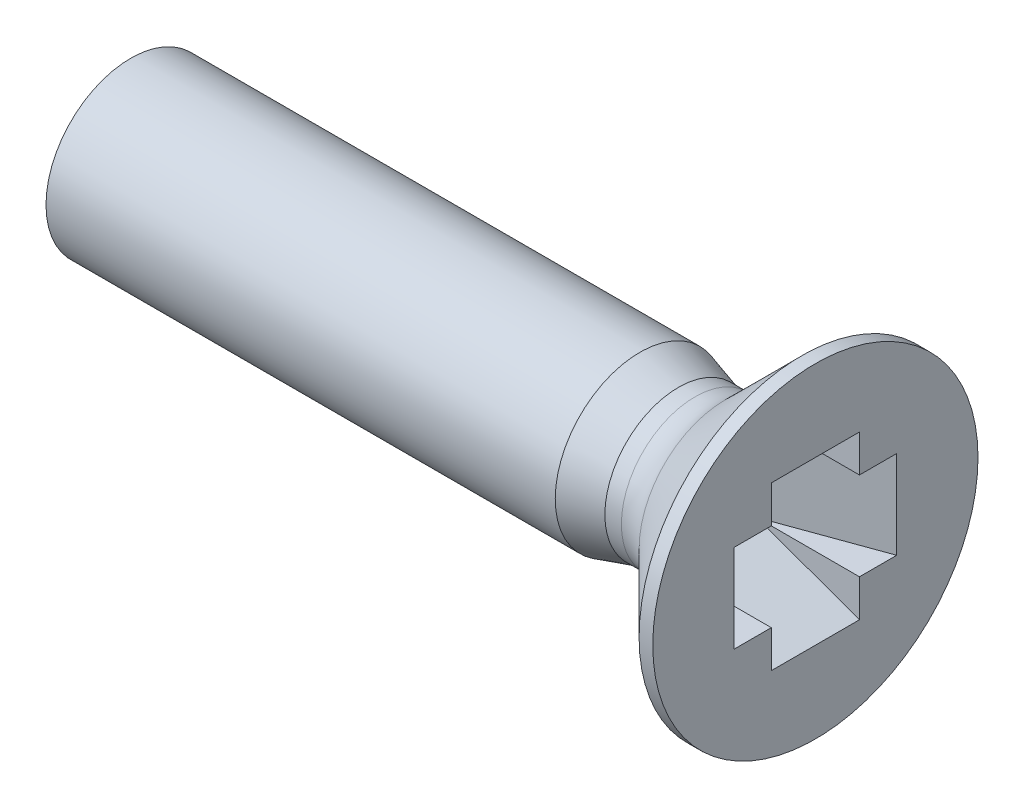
from build123d import *

# Parameters (mm, degrees)
EXTRUSION1_DEPTH = 1.03
EXTRUSION2_DEPTH = 1.03
EXTRUSION3_DEPTH = 1.03
CONG_1_R         = 0.5


with BuildPart() as part:
    # Esquisse1 → R_volution1 (revolve)
    with BuildSketch(Plane(origin=(0, 0, 0), x_dir=(-1, 0, 0), z_dir=(0, 0, -1)), mode=Mode.PRIVATE) as r_volution1_sk:
        Polygon((0, 1.9), (0, 0), (8, 0), (8, 0.99), (2.04978903, 0.99), (1.6, 0.86), (1.2, 0.86), (0.16, 1.9), align=None)
    revolve(r_volution1_sk.sketch.rotate(Axis((0, 0, 0), (-1, 0, 0)), 270), axis=Axis((0, 0, 0), (-1, 0, 0)))

    # Esquisse2 → Extrusion1 (cut)
    with BuildSketch(Plane.XY.offset(0.515)):
        Polygon((0, -0.95), (0, 0.95), (-1.2, 0.515), (-1.2, -0.515), align=None)
    extrude(amount=-EXTRUSION1_DEPTH, mode=Mode.SUBTRACT)

    # Esquisse3 → Extrusion2 (cut)
    with BuildSketch(Plane.XZ.offset(0.515)):
        Polygon((0, 0.515), (0, 0.95), (-1.2, 0.515), align=None)
    extrude(amount=-EXTRUSION2_DEPTH, mode=Mode.SUBTRACT)

    # Esquisse4 → Extrusion3 (cut)
    with BuildSketch(Plane.XZ.offset(0.515)):
        Polygon((-1.2, -0.515), (0, -0.95), (0, -0.515), align=None)
    extrude(amount=-EXTRUSION3_DEPTH, mode=Mode.SUBTRACT)

    # Cong_1
    cong_1_edges = [part.edges().sort_by_distance(p)[0] for p in [
        (-1.2, 0, -0.86),
    ]]
    fillet(cong_1_edges, radius=CONG_1_R)


solid = part.part
